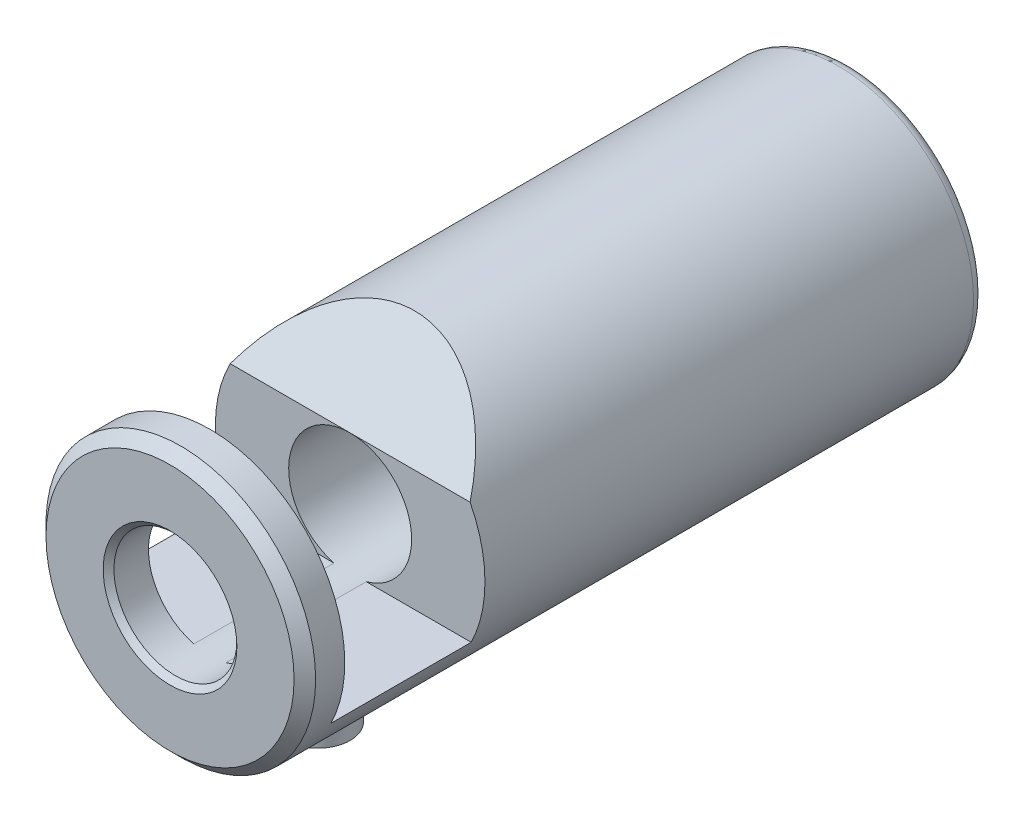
ISO-10303-21;
HEADER;
FILE_DESCRIPTION(('STEP AP214'),'2;1');
FILE_NAME('part.step','',(''),(''),'','','');
FILE_SCHEMA(('AUTOMOTIVE_DESIGN { 1 0 10303 214 1 1 1 1 }'));
ENDSEC;
DATA;
#1=APPLICATION_CONTEXT('core data for automotive mechanical design processes');
#2=APPLICATION_PROTOCOL_DEFINITION('international standard','automotive_design',2000,#1);
#3=PRODUCT_CONTEXT('',#1,'mechanical');
#4=PRODUCT('Part','Part','',(#3));
#5=PRODUCT_RELATED_PRODUCT_CATEGORY('part','',(#4));
#6=PRODUCT_DEFINITION_FORMATION('','',#4);
#7=PRODUCT_DEFINITION_CONTEXT('part definition',#1,'design');
#8=PRODUCT_DEFINITION('design','',#6,#7);
#9=PRODUCT_DEFINITION_SHAPE('','',#8);
#10=(LENGTH_UNIT() NAMED_UNIT(*) SI_UNIT(.MILLI.,.METRE.));
#11=(NAMED_UNIT(*) PLANE_ANGLE_UNIT() SI_UNIT($,.RADIAN.));
#12=(NAMED_UNIT(*) SI_UNIT($,.STERADIAN.) SOLID_ANGLE_UNIT());
#13=UNCERTAINTY_MEASURE_WITH_UNIT(LENGTH_MEASURE(1.E-05),#10,'distance_accuracy_value','');
#14=(GEOMETRIC_REPRESENTATION_CONTEXT(3) GLOBAL_UNCERTAINTY_ASSIGNED_CONTEXT((#13)) GLOBAL_UNIT_ASSIGNED_CONTEXT((#10,
#11,#12)) REPRESENTATION_CONTEXT('',''));
#15=CARTESIAN_POINT('',(0.,0.,0.));
#16=DIRECTION('',(0.,0.,1.));
#17=DIRECTION('',(1.,0.,0.));
#18=AXIS2_PLACEMENT_3D('',#15,#16,#17);
#19=CARTESIAN_POINT('',(0.,0.,31.5));
#20=DIRECTION('',(0.,0.,-1.));
#21=DIRECTION('',(-1.,0.,0.));
#22=AXIS2_PLACEMENT_3D('',#19,#20,#21);
#23=CYLINDRICAL_SURFACE('',#22,6.25);
#24=CARTESIAN_POINT('',(0.,0.,31.));
#25=DIRECTION('',(0.,0.,1.));
#26=DIRECTION('',(1.,0.,0.));
#27=AXIS2_PLACEMENT_3D('',#24,#25,#26);
#28=CIRCLE('',#27,6.25);
#29=CARTESIAN_POINT('',(6.25,0.,31.));
#30=VERTEX_POINT('',#29);
#31=EDGE_CURVE('E126',#30,#30,#28,.F.);
#32=ORIENTED_EDGE('',*,*,#31,.T.);
#33=EDGE_LOOP('',(#32));
#34=FACE_BOUND('',#33,.T.);
#35=CARTESIAN_POINT('',(0.,0.,0.5));
#36=DIRECTION('',(0.,0.,1.));
#37=DIRECTION('',(1.,0.,0.));
#38=AXIS2_PLACEMENT_3D('',#35,#36,#37);
#39=CIRCLE('',#38,6.25);
#40=CARTESIAN_POINT('',(6.25,0.,0.5));
#41=VERTEX_POINT('',#40);
#42=EDGE_CURVE('E129',#41,#41,#39,.T.);
#43=ORIENTED_EDGE('',*,*,#42,.T.);
#44=EDGE_LOOP('',(#43));
#45=FACE_BOUND('',#44,.T.);
#46=CARTESIAN_POINT('',(0.,-6.25000000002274,23.15));
#47=CARTESIAN_POINT('',(-0.0829819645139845,-6.24999853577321,23.1500025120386));
#48=CARTESIAN_POINT('',(-0.165992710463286,-6.24833078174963,23.156909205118));
#49=CARTESIAN_POINT('',(-0.329642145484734,-6.24183919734,23.1843163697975));
#50=CARTESIAN_POINT('',(-0.41027934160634,-6.23701342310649,23.2048252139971));
#51=CARTESIAN_POINT('',(-0.566794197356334,-6.22474116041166,23.2587461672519));
#52=CARTESIAN_POINT('',(-0.64267721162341,-6.21729768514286,23.2921434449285));
#53=CARTESIAN_POINT('',(-0.787762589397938,-6.20058627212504,23.3708427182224));
#54=CARTESIAN_POINT('',(-0.856964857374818,-6.19131830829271,23.4161448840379));
#55=CARTESIAN_POINT('',(-0.98804631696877,-6.17176930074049,23.5182820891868));
#56=CARTESIAN_POINT('',(-1.04977976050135,-6.16147362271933,23.5753013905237));
#57=CARTESIAN_POINT('',(-1.16290540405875,-6.14112871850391,23.6988594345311));
#58=CARTESIAN_POINT('',(-1.21429652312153,-6.13107951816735,23.7653991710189));
#59=CARTESIAN_POINT('',(-1.30594996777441,-6.11221898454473,23.9072229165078));
#60=CARTESIAN_POINT('',(-1.34605188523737,-6.1034262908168,23.9826132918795));
#61=CARTESIAN_POINT('',(-1.412957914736,-6.08828667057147,24.1393099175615));
#62=CARTESIAN_POINT('',(-1.43976397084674,-6.08193938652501,24.220615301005));
#63=CARTESIAN_POINT('',(-1.47882529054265,-6.07255923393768,24.3852382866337));
#64=CARTESIAN_POINT('',(-1.49134131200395,-6.06946705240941,24.4684905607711));
#65=CARTESIAN_POINT('',(-1.50227904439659,-6.06676948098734,24.6359661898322));
#66=CARTESIAN_POINT('',(-1.50070285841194,-6.06716357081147,24.7201893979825));
#67=CARTESIAN_POINT('',(-1.48370956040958,-6.07134056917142,24.8852379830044));
#68=CARTESIAN_POINT('',(-1.46860051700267,-6.07504804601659,24.9660972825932));
#69=CARTESIAN_POINT('',(-1.42546070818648,-6.08531418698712,25.1240986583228));
#70=CARTESIAN_POINT('',(-1.39742908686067,-6.09187303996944,25.201240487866));
#71=CARTESIAN_POINT('',(-1.32897060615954,-6.10717383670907,25.3504564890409));
#72=CARTESIAN_POINT('',(-1.28842974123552,-6.11593571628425,25.4224762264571));
#73=CARTESIAN_POINT('',(-1.19618344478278,-6.13464375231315,25.5588022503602));
#74=CARTESIAN_POINT('',(-1.14447620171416,-6.14459010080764,25.6231072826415));
#75=CARTESIAN_POINT('',(-1.02975746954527,-6.16486601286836,25.7439467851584));
#76=CARTESIAN_POINT('',(-0.966485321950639,-6.17519878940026,25.8002335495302));
#77=CARTESIAN_POINT('',(-0.831277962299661,-6.19484757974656,25.9014423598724));
#78=CARTESIAN_POINT('',(-0.759342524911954,-6.20416356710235,25.9463641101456));
#79=CARTESIAN_POINT('',(-0.608514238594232,-6.22076974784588,26.0236486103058));
#80=CARTESIAN_POINT('',(-0.52960139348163,-6.22805385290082,26.0559737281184));
#81=CARTESIAN_POINT('',(-0.367248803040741,-6.23973102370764,26.1068325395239));
#82=CARTESIAN_POINT('',(-0.283809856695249,-6.24412459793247,26.1253686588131));
#83=CARTESIAN_POINT('',(-0.116893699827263,-6.2494513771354,26.1477510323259));
#84=CARTESIAN_POINT('',(-0.0334642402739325,-6.25046410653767,26.1519349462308));
#85=CARTESIAN_POINT('',(0.132902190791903,-6.2491403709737,26.1464166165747));
#86=CARTESIAN_POINT('',(0.21583920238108,-6.24680418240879,26.1367155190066));
#87=CARTESIAN_POINT('',(0.377711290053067,-6.23909581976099,26.1039815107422));
#88=CARTESIAN_POINT('',(0.45668528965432,-6.23376507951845,26.0811304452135));
#89=CARTESIAN_POINT('',(0.609676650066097,-6.22066675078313,26.022950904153));
#90=CARTESIAN_POINT('',(0.68369353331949,-6.21289892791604,25.9876212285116));
#91=CARTESIAN_POINT('',(0.826030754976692,-6.19559550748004,25.9048167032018));
#92=CARTESIAN_POINT('',(0.894235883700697,-6.18603265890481,25.8571496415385));
#93=CARTESIAN_POINT('',(1.02179952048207,-6.16624682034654,25.7512715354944));
#94=CARTESIAN_POINT('',(1.08115662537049,-6.15602372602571,25.6930588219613));
#95=CARTESIAN_POINT('',(1.19071226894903,-6.13578710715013,25.5661795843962));
#96=CARTESIAN_POINT('',(1.2406748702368,-6.12578346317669,25.4973074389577));
#97=CARTESIAN_POINT('',(1.32833010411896,-6.10737693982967,25.3519547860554));
#98=CARTESIAN_POINT('',(1.36602328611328,-6.09897398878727,25.2754746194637));
#99=CARTESIAN_POINT('',(1.42779496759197,-6.08480947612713,25.1174937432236));
#100=CARTESIAN_POINT('',(1.45195377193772,-6.0790323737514,25.036025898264));
#101=CARTESIAN_POINT('',(1.48619190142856,-6.07075363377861,24.8700269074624));
#102=CARTESIAN_POINT('',(1.49627402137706,-6.06825134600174,24.7854963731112));
#103=CARTESIAN_POINT('',(1.50193533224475,-6.06685231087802,24.6181646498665));
#104=CARTESIAN_POINT('',(1.49789053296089,-6.06786208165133,24.5353767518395));
#105=CARTESIAN_POINT('',(1.47626672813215,-6.07315882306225,24.3717001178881));
#106=CARTESIAN_POINT('',(1.45868795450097,-6.07744573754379,24.2908113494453));
#107=CARTESIAN_POINT('',(1.41069295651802,-6.08876374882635,24.1336012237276));
#108=CARTESIAN_POINT('',(1.38034201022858,-6.09578087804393,24.0572588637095));
#109=CARTESIAN_POINT('',(1.30771686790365,-6.11177168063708,23.9106977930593));
#110=CARTESIAN_POINT('',(1.26544114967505,-6.12074560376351,23.840479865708));
#111=CARTESIAN_POINT('',(1.16896503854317,-6.13990966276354,23.7063314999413));
#112=CARTESIAN_POINT('',(1.114501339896,-6.15012393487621,23.6425938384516));
#113=CARTESIAN_POINT('',(0.995715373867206,-6.17046799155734,23.5250400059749));
#114=CARTESIAN_POINT('',(0.931390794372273,-6.18059775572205,23.4712261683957));
#115=CARTESIAN_POINT('',(0.793441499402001,-6.19982851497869,23.3741953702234));
#116=CARTESIAN_POINT('',(0.719682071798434,-6.20891001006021,23.3311657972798));
#117=CARTESIAN_POINT('',(0.565768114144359,-6.22481903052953,23.2581852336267));
#118=CARTESIAN_POINT('',(0.485618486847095,-6.23164826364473,23.2282243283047));
#119=CARTESIAN_POINT('',(0.337943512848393,-6.24120299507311,23.1869806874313));
#120=CARTESIAN_POINT('',(0.271156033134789,-6.24447997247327,23.1731416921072));
#121=CARTESIAN_POINT('',(0.13625211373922,-6.24887900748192,23.1546506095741));
#122=CARTESIAN_POINT('',(0.0681357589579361,-6.25000120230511,23.1499979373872));
#123=CARTESIAN_POINT('',(0.,-6.25000000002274,23.15));
#124=B_SPLINE_CURVE_WITH_KNOTS('',3,(#46,#47,#48,#49,#50,#51,#52,#53,#54,#55,#56,#57,#58,#59,
#60,#61,#62,#63,#64,#65,#66,#67,#68,#69,#70,#71,#72,#73,#74,#75,#76,#77,#78,#79,#80,#81,#82,#83,
#84,#85,#86,#87,#88,#89,#90,#91,#92,#93,#94,#95,#96,#97,#98,#99,#100,#101,#102,#103,#104,#105,
#106,#107,#108,#109,#110,#111,#112,#113,#114,#115,#116,#117,#118,#119,#120,#121,#122,#123),
.UNSPECIFIED.,.T.,.F.,(4,2,2,2,2,2,2,2,2,2,2,2,2,2,2,2,2,2,2,2,2,2,2,2,2,2,2,2,2,2,2,2,2,2,2,2,
2,2,4),(0.,0.248696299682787,0.497545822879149,0.746109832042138,0.994677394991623,
1.24750285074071,1.50035471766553,1.75663631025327,2.01288041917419,2.26436997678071,
2.51582200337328,2.76169137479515,3.00757703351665,3.2557733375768,3.50400993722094,
3.75874979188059,4.01349627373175,4.26899807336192,4.52445491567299,4.77385888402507,
5.0232422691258,5.26925718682,5.5152957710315,5.76542616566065,6.01559618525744,6.2713912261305,
6.52717481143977,6.78142420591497,7.03562311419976,7.28310827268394,7.53058919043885,
7.77682031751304,8.02308289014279,8.27529223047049,8.52756079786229,8.78394871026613,
9.04014177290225,9.24435711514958,9.44855945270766),.UNSPECIFIED.);
#125=CARTESIAN_POINT('',(0.,-6.25000000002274,23.15));
#126=VERTEX_POINT('',#125);
#127=EDGE_CURVE('E154',#126,#126,#124,.T.);
#128=ORIENTED_EDGE('',*,*,#127,.T.);
#129=EDGE_LOOP('',(#128));
#130=FACE_BOUND('',#129,.T.);
#131=CARTESIAN_POINT('',(0.,0.,25.6647058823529));
#132=DIRECTION('',(0.,0.661621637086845,0.749837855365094));
#133=DIRECTION('',(0.,0.749837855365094,-0.661621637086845));
#134=AXIS2_PLACEMENT_3D('',#131,#132,#133);
#135=ELLIPSE('',#134,8.33513532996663,6.25);
#136=CARTESIAN_POINT('',(-5.56237359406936,2.84999999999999,23.15));
#137=VERTEX_POINT('',#136);
#138=CARTESIAN_POINT('',(5.56237359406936,2.84999999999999,23.15));
#139=VERTEX_POINT('',#138);
#140=EDGE_CURVE('E84',#137,#139,#135,.F.);
#141=ORIENTED_EDGE('',*,*,#140,.T.);
#142=CARTESIAN_POINT('',(0.,0.,23.15));
#143=DIRECTION('',(0.,0.,1.));
#144=DIRECTION('',(1.,0.,0.));
#145=AXIS2_PLACEMENT_3D('',#142,#143,#144);
#146=CIRCLE('',#145,6.25);
#147=CARTESIAN_POINT('',(5.61248608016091,-2.75,23.15));
#148=VERTEX_POINT('',#147);
#149=EDGE_CURVE('E98',#139,#148,#146,.F.);
#150=ORIENTED_EDGE('',*,*,#149,.T.);
#151=DIRECTION('',(0.,0.,-1.));
#152=VECTOR('',#151,1.);
#153=CARTESIAN_POINT('',(5.61248608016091,-2.75,31.5));
#154=LINE('',#153,#152);
#155=CARTESIAN_POINT('',(5.61248608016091,-2.75,29.65));
#156=VERTEX_POINT('',#155);
#157=EDGE_CURVE('E111',#156,#148,#154,.T.);
#158=ORIENTED_EDGE('',*,*,#157,.F.);
#159=CARTESIAN_POINT('',(0.,0.,29.65));
#160=DIRECTION('',(0.,0.,-1.));
#161=DIRECTION('',(-1.,0.,0.));
#162=AXIS2_PLACEMENT_3D('',#159,#160,#161);
#163=CIRCLE('',#162,6.25);
#164=CARTESIAN_POINT('',(-5.61248608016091,-2.75,29.65));
#165=VERTEX_POINT('',#164);
#166=EDGE_CURVE('E102',#156,#165,#163,.F.);
#167=ORIENTED_EDGE('',*,*,#166,.T.);
#168=DIRECTION('',(0.,0.,-1.));
#169=VECTOR('',#168,1.);
#170=CARTESIAN_POINT('',(-5.61248608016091,-2.75,31.5));
#171=LINE('',#170,#169);
#172=CARTESIAN_POINT('',(-5.61248608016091,-2.75,23.15));
#173=VERTEX_POINT('',#172);
#174=EDGE_CURVE('E96',#173,#165,#171,.F.);
#175=ORIENTED_EDGE('',*,*,#174,.F.);
#176=EDGE_CURVE('E54',#173,#137,#146,.F.);
#177=ORIENTED_EDGE('',*,*,#176,.T.);
#178=EDGE_LOOP('',(#141,#150,#158,#167,#175,#177));
#179=FACE_BOUND('',#178,.T.);
#180=ADVANCED_FACE('F34',(#34,#45,#130,#179),#23,.T.);
#181=CARTESIAN_POINT('',(-7.49999999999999,-2.75,23.15));
#182=DIRECTION('',(0.,0.,-1.));
#183=DIRECTION('',(-1.,0.,0.));
#184=AXIS2_PLACEMENT_3D('',#181,#182,#183);
#185=PLANE('',#184);
#186=DIRECTION('',(1.,0.,0.));
#187=VECTOR('',#186,1.);
#188=CARTESIAN_POINT('',(-7.49999999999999,2.84999999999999,23.15));
#189=LINE('',#188,#187);
#190=CARTESIAN_POINT('',(0.,2.84999999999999,23.15));
#191=VERTEX_POINT('',#190);
#192=EDGE_CURVE('E11',#137,#191,#189,.T.);
#193=ORIENTED_EDGE('',*,*,#192,.F.);
#194=ORIENTED_EDGE('',*,*,#176,.F.);
#195=DIRECTION('',(-1.,0.,0.));
#196=VECTOR('',#195,1.);
#197=CARTESIAN_POINT('',(-7.49999999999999,-2.75,23.15));
#198=LINE('',#197,#196);
#199=CARTESIAN_POINT('',(-0.748331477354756,-2.75,23.15));
#200=VERTEX_POINT('',#199);
#201=EDGE_CURVE('E97',#200,#173,#198,.T.);
#202=ORIENTED_EDGE('',*,*,#201,.F.);
#203=CARTESIAN_POINT('',(0.,0.,23.15));
#204=DIRECTION('',(0.,0.,-1.));
#205=DIRECTION('',(-1.,0.,0.));
#206=AXIS2_PLACEMENT_3D('',#203,#204,#205);
#207=CIRCLE('',#206,2.84999999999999);
#208=EDGE_CURVE('E92',#191,#200,#207,.F.);
#209=ORIENTED_EDGE('',*,*,#208,.F.);
#210=EDGE_LOOP('',(#193,#194,#202,#209));
#211=FACE_BOUND('',#210,.T.);
#212=ADVANCED_FACE('F91',(#211),#185,.F.);
#213=DIRECTION('',(-1.,0.,0.));
#214=VECTOR('',#213,1.);
#215=CARTESIAN_POINT('',(6.251,2.84999999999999,23.15));
#216=LINE('',#215,#214);
#217=EDGE_CURVE('E86',#139,#191,#216,.T.);
#218=ORIENTED_EDGE('',*,*,#217,.T.);
#219=CARTESIAN_POINT('',(0.748331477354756,-2.75,23.15));
#220=VERTEX_POINT('',#219);
#221=EDGE_CURVE('E137',#220,#191,#207,.F.);
#222=ORIENTED_EDGE('',*,*,#221,.F.);
#223=EDGE_CURVE('E100',#148,#220,#198,.T.);
#224=ORIENTED_EDGE('',*,*,#223,.F.);
#225=ORIENTED_EDGE('',*,*,#149,.F.);
#226=EDGE_LOOP('',(#218,#222,#224,#225));
#227=FACE_BOUND('',#226,.T.);
#228=ADVANCED_FACE('F153',(#227),#185,.F.);
#229=CARTESIAN_POINT('',(0.,0.,31.5));
#230=DIRECTION('',(0.,0.,1.));
#231=DIRECTION('',(1.,0.,0.));
#232=AXIS2_PLACEMENT_3D('',#229,#230,#231);
#233=CYLINDRICAL_SURFACE('',#232,2.84999999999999);
#234=CARTESIAN_POINT('',(0.,0.,31.25));
#235=DIRECTION('',(0.,0.,1.));
#236=DIRECTION('',(1.,0.,0.));
#237=AXIS2_PLACEMENT_3D('',#234,#235,#236);
#238=CIRCLE('',#237,2.85);
#239=CARTESIAN_POINT('',(2.85,0.,31.25));
#240=VERTEX_POINT('',#239);
#241=EDGE_CURVE('E117',#240,#240,#238,.T.);
#242=ORIENTED_EDGE('',*,*,#241,.T.);
#243=EDGE_LOOP('',(#242));
#244=FACE_BOUND('',#243,.T.);
#245=CARTESIAN_POINT('',(0.,0.,4.5));
#246=DIRECTION('',(0.,0.,1.));
#247=DIRECTION('',(1.,0.,0.));
#248=AXIS2_PLACEMENT_3D('',#245,#246,#247);
#249=CIRCLE('',#248,2.84999999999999);
#250=CARTESIAN_POINT('',(2.84999999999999,0.,4.5));
#251=VERTEX_POINT('',#250);
#252=EDGE_CURVE('E120',#251,#251,#249,.T.);
#253=ORIENTED_EDGE('',*,*,#252,.F.);
#254=EDGE_LOOP('',(#253));
#255=FACE_BOUND('',#254,.T.);
#256=DIRECTION('',(0.,0.,1.));
#257=VECTOR('',#256,1.);
#258=CARTESIAN_POINT('',(-0.748331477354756,-2.75,31.5));
#259=LINE('',#258,#257);
#260=CARTESIAN_POINT('',(-0.748331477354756,-2.75,29.65));
#261=VERTEX_POINT('',#260);
#262=EDGE_CURVE('E42',#261,#200,#259,.F.);
#263=ORIENTED_EDGE('',*,*,#262,.F.);
#264=CARTESIAN_POINT('',(0.,0.,29.65));
#265=DIRECTION('',(0.,0.,1.));
#266=DIRECTION('',(1.,0.,0.));
#267=AXIS2_PLACEMENT_3D('',#264,#265,#266);
#268=CIRCLE('',#267,2.84999999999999);
#269=CARTESIAN_POINT('',(0.748331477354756,-2.75,29.65));
#270=VERTEX_POINT('',#269);
#271=EDGE_CURVE('E139',#261,#270,#268,.F.);
#272=ORIENTED_EDGE('',*,*,#271,.T.);
#273=DIRECTION('',(0.,0.,1.));
#274=VECTOR('',#273,1.);
#275=CARTESIAN_POINT('',(0.748331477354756,-2.75,31.5));
#276=LINE('',#275,#274);
#277=EDGE_CURVE('E135',#220,#270,#276,.T.);
#278=ORIENTED_EDGE('',*,*,#277,.F.);
#279=ORIENTED_EDGE('',*,*,#221,.T.);
#280=ORIENTED_EDGE('',*,*,#208,.T.);
#281=EDGE_LOOP('',(#263,#272,#278,#279,#280));
#282=FACE_BOUND('',#281,.T.);
#283=ADVANCED_FACE('F148',(#244,#255,#282),#233,.F.);
#284=CARTESIAN_POINT('',(0.,0.,31.5));
#285=DIRECTION('',(0.,0.,1.));
#286=DIRECTION('',(1.,0.,0.));
#287=AXIS2_PLACEMENT_3D('',#284,#285,#286);
#288=PLANE('',#287);
#289=CARTESIAN_POINT('',(0.,0.,31.5));
#290=DIRECTION('',(0.,0.,1.));
#291=DIRECTION('',(1.,0.,0.));
#292=AXIS2_PLACEMENT_3D('',#289,#290,#291);
#293=CIRCLE('',#292,3.1);
#294=CARTESIAN_POINT('',(3.1,0.,31.5));
#295=VERTEX_POINT('',#294);
#296=EDGE_CURVE('E114',#295,#295,#293,.T.);
#297=ORIENTED_EDGE('',*,*,#296,.F.);
#298=EDGE_LOOP('',(#297));
#299=FACE_BOUND('',#298,.T.);
#300=CARTESIAN_POINT('',(0.,0.,31.5));
#301=DIRECTION('',(0.,0.,1.));
#302=DIRECTION('',(1.,0.,0.));
#303=AXIS2_PLACEMENT_3D('',#300,#301,#302);
#304=CIRCLE('',#303,5.75);
#305=CARTESIAN_POINT('',(5.75,0.,31.5));
#306=VERTEX_POINT('',#305);
#307=EDGE_CURVE('E123',#306,#306,#304,.T.);
#308=ORIENTED_EDGE('',*,*,#307,.T.);
#309=EDGE_LOOP('',(#308));
#310=FACE_BOUND('',#309,.T.);
#311=ADVANCED_FACE('F192',(#299,#310),#288,.T.);
#312=CARTESIAN_POINT('',(0.,0.,0.));
#313=DIRECTION('',(0.,0.,1.));
#314=DIRECTION('',(1.,0.,0.));
#315=AXIS2_PLACEMENT_3D('',#312,#313,#314);
#316=PLANE('',#315);
#317=CARTESIAN_POINT('',(0.,0.,0.));
#318=DIRECTION('',(0.,0.,1.));
#319=DIRECTION('',(1.,0.,0.));
#320=AXIS2_PLACEMENT_3D('',#317,#318,#319);
#321=CIRCLE('',#320,5.75);
#322=CARTESIAN_POINT('',(5.75,0.,0.));
#323=VERTEX_POINT('',#322);
#324=EDGE_CURVE('E132',#323,#323,#321,.F.);
#325=ORIENTED_EDGE('',*,*,#324,.T.);
#326=EDGE_LOOP('',(#325));
#327=FACE_BOUND('',#326,.T.);
#328=ADVANCED_FACE('F199',(#327),#316,.F.);
#329=CARTESIAN_POINT('',(0.,0.,31.5));
#330=DIRECTION('',(0.,0.,-1.));
#331=DIRECTION('',(-1.,0.,0.));
#332=AXIS2_PLACEMENT_3D('',#329,#330,#331);
#333=CONICAL_SURFACE('',#332,5.75,0.785398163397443);
#334=ORIENTED_EDGE('',*,*,#31,.F.);
#335=EDGE_LOOP('',(#334));
#336=FACE_BOUND('',#335,.T.);
#337=ORIENTED_EDGE('',*,*,#307,.F.);
#338=EDGE_LOOP('',(#337));
#339=FACE_BOUND('',#338,.T.);
#340=ADVANCED_FACE('F203',(#336,#339),#333,.T.);
#341=CARTESIAN_POINT('',(0.,0.,0.5));
#342=DIRECTION('',(0.,0.,1.));
#343=DIRECTION('',(1.,0.,0.));
#344=AXIS2_PLACEMENT_3D('',#341,#342,#343);
#345=TOROIDAL_SURFACE('',#344,5.75,0.5);
#346=ORIENTED_EDGE('',*,*,#324,.F.);
#347=EDGE_LOOP('',(#346));
#348=FACE_BOUND('',#347,.T.);
#349=ORIENTED_EDGE('',*,*,#42,.F.);
#350=EDGE_LOOP('',(#349));
#351=FACE_BOUND('',#350,.T.);
#352=ADVANCED_FACE('F36',(#348,#351),#345,.T.);
#353=CARTESIAN_POINT('',(0.,0.,4.5));
#354=DIRECTION('',(0.,0.,1.));
#355=DIRECTION('',(1.,0.,0.));
#356=AXIS2_PLACEMENT_3D('',#353,#354,#355);
#357=CONICAL_SURFACE('',#356,2.84999999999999,1.02974425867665);
#358=CARTESIAN_POINT('',(0.,0.,2.78754723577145));
#359=VERTEX_POINT('',#358);
#360=VERTEX_LOOP('',#359);
#361=FACE_BOUND('',#360,.T.);
#362=ORIENTED_EDGE('',*,*,#252,.T.);
#363=EDGE_LOOP('',(#362));
#364=FACE_BOUND('',#363,.T.);
#365=ADVANCED_FACE('F188',(#361,#364),#357,.F.);
#366=CARTESIAN_POINT('',(0.,0.,31.5));
#367=DIRECTION('',(0.,0.,1.));
#368=DIRECTION('',(1.,0.,0.));
#369=AXIS2_PLACEMENT_3D('',#366,#367,#368);
#370=CONICAL_SURFACE('',#369,3.1,0.785398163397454);
#371=ORIENTED_EDGE('',*,*,#241,.F.);
#372=EDGE_LOOP('',(#371));
#373=FACE_BOUND('',#372,.T.);
#374=ORIENTED_EDGE('',*,*,#296,.T.);
#375=EDGE_LOOP('',(#374));
#376=FACE_BOUND('',#375,.T.);
#377=ADVANCED_FACE('F182',(#373,#376),#370,.F.);
#378=CARTESIAN_POINT('',(-7.49999999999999,-2.75,29.65));
#379=DIRECTION('',(0.,0.,1.));
#380=DIRECTION('',(1.,0.,0.));
#381=AXIS2_PLACEMENT_3D('',#378,#379,#380);
#382=PLANE('',#381);
#383=ORIENTED_EDGE('',*,*,#166,.F.);
#384=DIRECTION('',(1.,0.,0.));
#385=VECTOR('',#384,1.);
#386=CARTESIAN_POINT('',(-7.49999999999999,-2.75,29.65));
#387=LINE('',#386,#385);
#388=EDGE_CURVE('E106',#270,#156,#387,.T.);
#389=ORIENTED_EDGE('',*,*,#388,.F.);
#390=ORIENTED_EDGE('',*,*,#271,.F.);
#391=EDGE_CURVE('E109',#165,#261,#387,.T.);
#392=ORIENTED_EDGE('',*,*,#391,.F.);
#393=EDGE_LOOP('',(#383,#389,#390,#392));
#394=FACE_BOUND('',#393,.T.);
#395=ADVANCED_FACE('F178',(#394),#382,.F.);
#396=CARTESIAN_POINT('',(0.,-2.75,0.));
#397=DIRECTION('',(0.,1.,0.));
#398=DIRECTION('',(0.,0.,1.));
#399=AXIS2_PLACEMENT_3D('',#396,#397,#398);
#400=PLANE('',#399);
#401=ORIENTED_EDGE('',*,*,#157,.T.);
#402=ORIENTED_EDGE('',*,*,#223,.T.);
#403=ORIENTED_EDGE('',*,*,#277,.T.);
#404=ORIENTED_EDGE('',*,*,#388,.T.);
#405=EDGE_LOOP('',(#401,#402,#403,#404));
#406=FACE_BOUND('',#405,.T.);
#407=ADVANCED_FACE('F175',(#406),#400,.T.);
#408=ORIENTED_EDGE('',*,*,#174,.T.);
#409=ORIENTED_EDGE('',*,*,#391,.T.);
#410=ORIENTED_EDGE('',*,*,#262,.T.);
#411=ORIENTED_EDGE('',*,*,#201,.T.);
#412=EDGE_LOOP('',(#408,#409,#410,#411));
#413=FACE_BOUND('',#412,.T.);
#414=ADVANCED_FACE('F145',(#413),#400,.T.);
#415=CARTESIAN_POINT('',(0.,-8.,24.65));
#416=DIRECTION('',(0.,1.,0.));
#417=DIRECTION('',(0.,0.,1.));
#418=AXIS2_PLACEMENT_3D('',#415,#416,#417);
#419=CYLINDRICAL_SURFACE('',#418,1.5);
#420=CARTESIAN_POINT('',(0.,-8.,24.65));
#421=DIRECTION('',(0.,1.,0.));
#422=DIRECTION('',(0.,0.,1.));
#423=AXIS2_PLACEMENT_3D('',#420,#421,#422);
#424=CIRCLE('',#423,1.5);
#425=CARTESIAN_POINT('',(0.,-8.,26.15));
#426=VERTEX_POINT('',#425);
#427=EDGE_CURVE('E157',#426,#426,#424,.T.);
#428=ORIENTED_EDGE('',*,*,#427,.T.);
#429=EDGE_LOOP('',(#428));
#430=FACE_BOUND('',#429,.T.);
#431=ORIENTED_EDGE('',*,*,#127,.F.);
#432=EDGE_LOOP('',(#431));
#433=FACE_BOUND('',#432,.T.);
#434=ADVANCED_FACE('F170',(#430,#433),#419,.T.);
#435=CARTESIAN_POINT('',(0.,-8.,24.65));
#436=DIRECTION('',(0.,1.,0.));
#437=DIRECTION('',(0.,0.,1.));
#438=AXIS2_PLACEMENT_3D('',#435,#436,#437);
#439=PLANE('',#438);
#440=ORIENTED_EDGE('',*,*,#427,.F.);
#441=EDGE_LOOP('',(#440));
#442=FACE_BOUND('',#441,.T.);
#443=ADVANCED_FACE('F167',(#442),#439,.F.);
#444=CARTESIAN_POINT('',(6.251,2.84999999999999,23.15));
#445=DIRECTION('',(0.,0.661621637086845,0.749837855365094));
#446=DIRECTION('',(0.,-0.749837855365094,0.661621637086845));
#447=AXIS2_PLACEMENT_3D('',#444,#445,#446);
#448=PLANE('',#447);
#449=ORIENTED_EDGE('',*,*,#217,.F.);
#450=ORIENTED_EDGE('',*,*,#140,.F.);
#451=ORIENTED_EDGE('',*,*,#192,.T.);
#452=EDGE_LOOP('',(#449,#450,#451));
#453=FACE_BOUND('',#452,.T.);
#454=ADVANCED_FACE('F85',(#453),#448,.T.);
#455=CLOSED_SHELL('',(#180,#212,#228,#283,#311,#328,#340,#352,#365,#377,#395,#407,#414,#434,
#443,#454));
#456=MANIFOLD_SOLID_BREP('B2',#455);
#457=ADVANCED_BREP_SHAPE_REPRESENTATION('',(#18,#456),#14);
#458=SHAPE_DEFINITION_REPRESENTATION(#9,#457);
ENDSEC;
END-ISO-10303-21;
